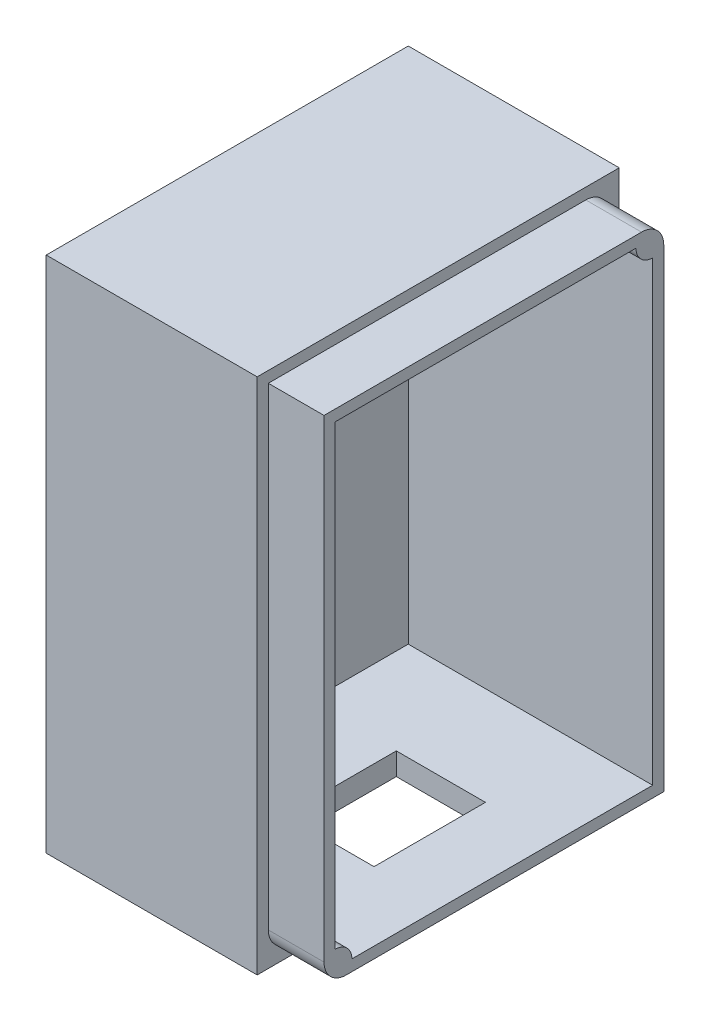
from build123d import *

# Parameters (mm, degrees)
SKETCH9_W           = 28.5
SKETCH9_H           = 42.5
BOSS_EXTRUDE2_DEPTH = 20
SHELL1_T            = 2
SKETCH13_R          = 4
CUT_EXTRUDE3_DEPTH  = 20
CUT_EXTRUDE4_DEPTH  = 45
SKETCH16_R          = 5
CUT_EXTRUDE5_DEPTH  = 9
CUT_EXTRUDE6_DEPTH  = 9
SKETCH18_W          = 10.869116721
SKETCH18_H          = 10.889459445
CUT_EXTRUDE7_DEPTH  = 1
SKETCH19_W          = 32.5
SKETCH19_H          = 46.5
SKETCH19_W_2        = 28.5
SKETCH19_H_2        = 42.5
BOSS_EXTRUDE3_DEPTH = 16
SKETCH21_R          = 1.5
BOSS_EXTRUDE4_DEPTH = 23.937925
SKETCH22_R          = 1.499227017
BOSS_EXTRUDE5_DEPTH = 23.937925
SKETCH24_W          = 8
SKETCH24_H          = 10
CUT_EXTRUDE9_DEPTH  = 25
CUT_EXTRUDE11_DEPTH = 5
CUT_EXTRUDE12_DEPTH = 5
FILLET1_R           = 2


with BuildPart() as part:
    # Sketch9 → Boss-Extrude2 (new body)
    with BuildSketch(Plane(origin=(0, 0, 0), x_dir=(0, 0, -1), z_dir=(1, 0, 0))):
        with Locations((-0.252212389, -5.10840708)):
            Rectangle(SKETCH9_W, SKETCH9_H)
    extrude(amount=BOSS_EXTRUDE2_DEPTH)

    # Shell1
    shell1_openings = [part.faces().sort_by_distance(p)[0] for p in [
        (20, -5.10840708, 0.252212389),
    ]]
    offset(amount=SHELL1_T, openings=shell1_openings, kind=Kind.INTERSECTION)

    # Sketch13 → Cut-Extrude3 (cut)
    with BuildSketch(Plane.ZY.offset(2)):
        with Locations((0.252212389, 6.14159292)):
            Circle(SKETCH13_R)
        Polygon((13.97143347, -17.263089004), (14.536325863, -14.432147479), (12.367104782, -12.527465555), (9.632991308, -13.453725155), (9.068098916, -16.28466668), (11.237319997, -18.189348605), align=None)
    extrude(amount=-CUT_EXTRUDE3_DEPTH, mode=Mode.SUBTRACT)

    # Sketch14 → Cut-Extrude4 (cut)
    with BuildSketch(Plane.XY.offset(16.502212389)):
        Polygon((5.937924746, 21.010526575), (5.937924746, -38.52738051), (34.577859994, -38.52738051), (26.806020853, 26.17065701), align=None)
    extrude(amount=-CUT_EXTRUDE4_DEPTH, mode=Mode.SUBTRACT)

    # Sketch16 → Cut-Extrude5 (cut)
    with BuildSketch(Plane.ZY.offset(2)):
        with Locations((0.252212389, 6.14159292)):
            Circle(SKETCH16_R)
    extrude(amount=-CUT_EXTRUDE5_DEPTH, mode=Mode.SUBTRACT)

    # Sketch17 → Cut-Extrude6 (cut)
    with BuildSketch(Plane.ZY.offset(2)):
        Polygon((13.82530443, -17.774965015), (15.201707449, -14.192469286), (12.787376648, -11.209221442), (8.996642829, -11.808469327), (7.62023981, -15.390965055), (10.034570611, -18.3742129), align=None)
    extrude(amount=-CUT_EXTRUDE6_DEPTH, mode=Mode.SUBTRACT)

    # Sketch18 → Cut-Extrude7 (cut)
    with BuildSketch(Plane(origin=(0, 0, 0), x_dir=(0, 0, -1), z_dir=(1, 0, 0))):
        with Locations((-0.252212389, 6.141592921)):
            Rectangle(SKETCH18_W, SKETCH18_H)
    extrude(amount=-CUT_EXTRUDE7_DEPTH, mode=Mode.SUBTRACT)

    # Sketch19 → Boss-Extrude3 (add)
    with BuildSketch(Plane(origin=(5.937924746, 0, 0), x_dir=(0, 0, -1), z_dir=(1, 0, 0))):
        with Locations((-0.252212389, -5.10840708)):
            Rectangle(SKETCH19_W, SKETCH19_H)
        with Locations((-0.252212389, -5.10840708)):
            Rectangle(SKETCH19_W_2, SKETCH19_H_2, mode=Mode.SUBTRACT)
    extrude(amount=BOSS_EXTRUDE3_DEPTH)

    # Sketch21 → Boss-Extrude4 (add)
    with BuildSketch(Plane(origin=(21.937924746, 0, 0), x_dir=(0, 0, -1), z_dir=(1, 0, 0))):
        with Locations((-14.502212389, -26.35840708)):
            Circle(SKETCH21_R)
    extrude(amount=-BOSS_EXTRUDE4_DEPTH)

    # Sketch22 → Boss-Extrude5 (add)
    with BuildSketch(Plane(origin=(21.937924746, 0, 0), x_dir=(0, 0, -1), z_dir=(1, 0, 0))):
        with Locations((13.997787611, 16.14159292)):
            Circle(SKETCH22_R)
    extrude(amount=-BOSS_EXTRUDE5_DEPTH)

    # Sketch24 → Cut-Extrude9 (cut)
    with BuildSketch(Plane.XZ.offset(28.35840708)):
        with Locations((11.762438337, -0.163014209)):
            Rectangle(SKETCH24_W, SKETCH24_H)
    extrude(amount=-CUT_EXTRUDE9_DEPTH, mode=Mode.SUBTRACT)

    # Sketch25 → Cut-Extrude11 (cut)
    with BuildSketch(Plane(origin=(21.937924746, 0, 0), x_dir=(0, 0, -1), z_dir=(1, 0, 0))):
        Polygon((15.997787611, 18.14159292), (15.997787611, -28.35840708), (14.997787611, -28.35840708), (14.997787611, -27.35840708), (14.997787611, 17.14159292), (-14.502212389, 17.14159292), (-16.502212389, 17.14159292), (-16.502212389, 18.14159292), align=None)
    extrude(amount=-CUT_EXTRUDE11_DEPTH, mode=Mode.SUBTRACT)

    # Sketch26 → Cut-Extrude12 (cut)
    with BuildSketch(Plane(origin=(21.937924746, 0, 0), x_dir=(0, 0, -1), z_dir=(1, 0, 0))):
        Polygon((14.997787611, -28.35840708), (14.997787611, -27.35840708), (-15.502212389, -27.35840708), (-15.502212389, 17.14159292), (-16.502212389, 17.14159292), (-16.502212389, -28.35840708), align=None)
    extrude(amount=-CUT_EXTRUDE12_DEPTH, mode=Mode.SUBTRACT)

    # Fillet1
    fillet1_edges = [part.edges().sort_by_distance(p)[0] for p in [
        (19.437924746, 17.14159292, -14.997787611),
        (19.437924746, -27.35840708, 15.502212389),
    ]]
    fillet(fillet1_edges, radius=FILLET1_R)


solid = part.part
